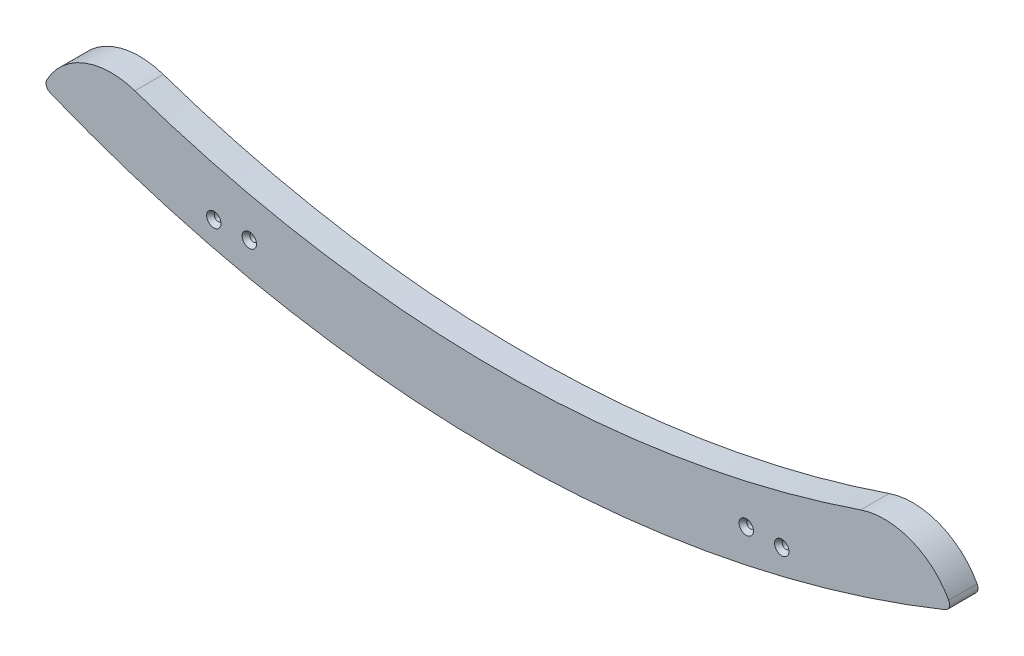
from build123d import *

# Parameters (mm, degrees)
BOSS_EXTRUDE1_DEPTH                              = 12.7
FILLET1_R                                        = 6.35
CSK_FOR_1_4_FLAT_HEAD_MACHINE_SCREW1_D           = 6.5278
CSK_FOR_1_4_FLAT_HEAD_MACHINE_SCREW1_CSINK_D     = 12.8778
CSK_FOR_1_4_FLAT_HEAD_MACHINE_SCREW1_CSINK_ANGLE = 82


with BuildPart() as part:
    # Sketch4 → Boss-Extrude1 (new, symmetric)
    with BuildSketch(Plane.XY):
        with BuildLine():
            ThreePointArc((-324.633635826, 89.823714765), (0, 35.851841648), (324.633635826, 89.823714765))
            ThreePointArc((324.633635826, 89.823714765), (372.85535722, 87.513537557), (406.4, 52.794259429))
            ThreePointArc((406.4, 52.794259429), (0, -27.648158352), (-406.4, 52.794259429))
            ThreePointArc((-406.4, 52.794259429), (-372.85535722, 87.513537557), (-324.633635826, 89.823714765))
        make_face()
    extrude(amount=BOSS_EXTRUDE1_DEPTH, both=True)

    # Fillet1
    fillet1_edges = [part.edges().sort_by_distance(p)[0] for p in [
        (-406.4, 52.794259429, 0),
        (406.4, 52.794259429, 0),
    ]]
    fillet(fillet1_edges, radius=FILLET1_R)

    # CSK for 1_4 Flat Head Machine Screw1 (through all)
    with Locations(Plane.XY.offset(12.7)):
        with Locations((-254, 25.4), (-222.25, 25.4), (222.25, 25.4), (254, 25.4)):
            CounterSinkHole(CSK_FOR_1_4_FLAT_HEAD_MACHINE_SCREW1_D / 2, CSK_FOR_1_4_FLAT_HEAD_MACHINE_SCREW1_CSINK_D / 2, counter_sink_angle=CSK_FOR_1_4_FLAT_HEAD_MACHINE_SCREW1_CSINK_ANGLE)


solid = part.part
